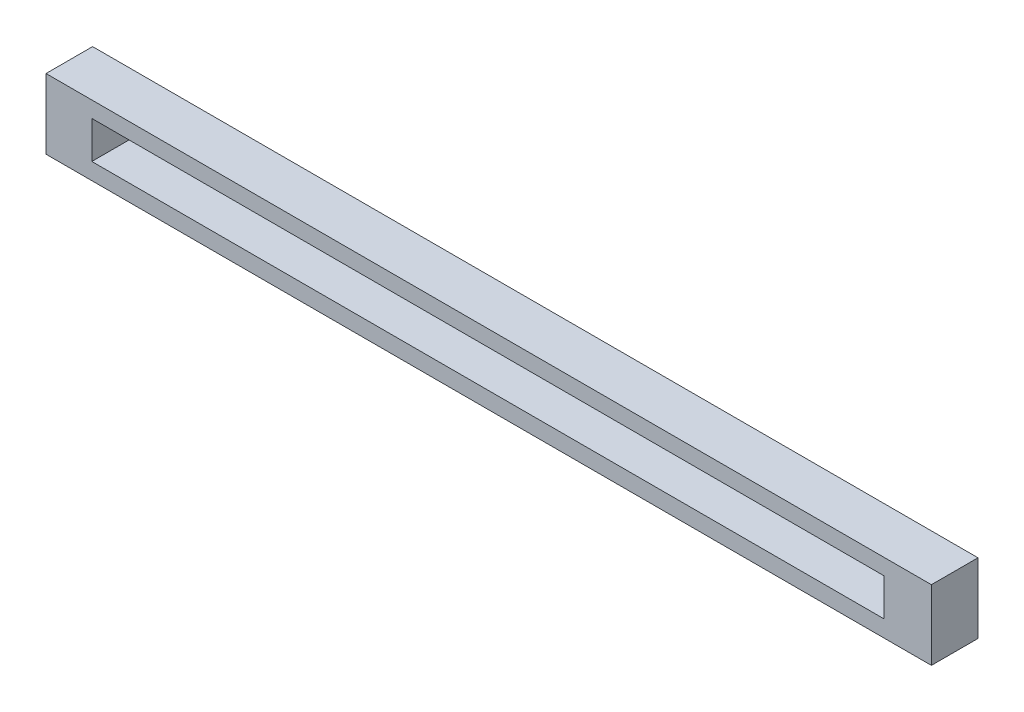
from build123d import *

# Parameters (mm, degrees)
SKETCH1_W          = 431.8
SKETCH1_H          = 20.32
BASE_EXTRUDE_DEPTH = 25.4


with BuildPart() as part:
    # Sketch1 → Base-Extrude (new body)
    with BuildSketch(Plane.XY):
        Polygon((482.51063232, 0), (5.040466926, 0), (0, 0), (0, 38.1), (5.040466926, 38.1), (482.51063232, 38.1), align=None)
        with Locations((240.863962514, 19.225595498)):
            Rectangle(SKETCH1_W, SKETCH1_H, mode=Mode.SUBTRACT)
    extrude(amount=-BASE_EXTRUDE_DEPTH)


solid = part.part
